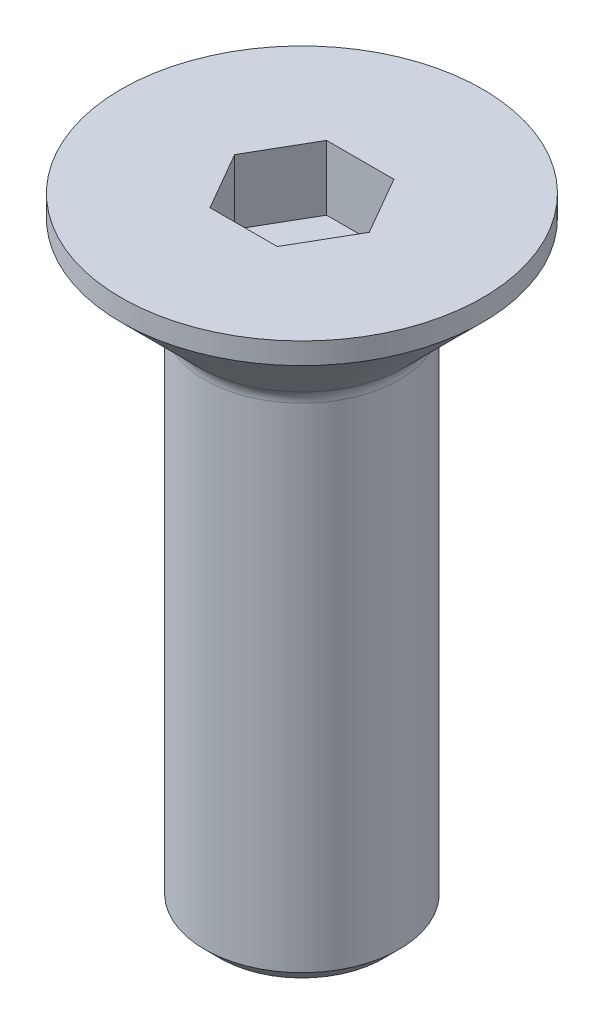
from build123d import *

# Parameters (mm, degrees)
ENL_V_MAT_EXTRU_1_DEPTH = 1.666666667


with BuildPart() as part:
    # Esquisse1 → R_volution1 (revolve)
    with BuildSketch(Plane.XY, mode=Mode.PRIVATE) as r_volution1_sk:
        with BuildLine():
            Line((4.65, -0.55), (2.646446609, -2.553553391))
            ThreePointArc((2.646446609, -2.553553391), (2.538060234, -2.715765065), (2.5, -2.907106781))
            Line((2.5, -2.907106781), (2.5, -15.6))
            Line((2.5, -15.6), (2.1, -16))
            Line((2.1, -16), (0, -16))
            Line((0, -16), (0, 0))
            Line((0, 0), (4.65, 0))
            Line((4.65, 0), (4.65, -0.55))
        make_face()
    revolve(r_volution1_sk.sketch.rotate(Axis((0, 0, 0), (0, -1, 0)), 180), axis=Axis((0, 0, 0), (0, -1, 0)))

    # Esquisse2 → Enl_v. mat.-Extru.1 (cut)
    with BuildSketch(Plane(origin=(0, 0, 0), x_dir=(1, 0, 0), z_dir=(0, 1, 0))):
        Polygon((1.732050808, 0), (0.866025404, 1.5), (-0.866025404, 1.5), (-1.732050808, 0), (-0.866025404, -1.5), (0.866025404, -1.5), align=None)
    extrude(amount=-ENL_V_MAT_EXTRU_1_DEPTH, mode=Mode.SUBTRACT)


solid = part.part
